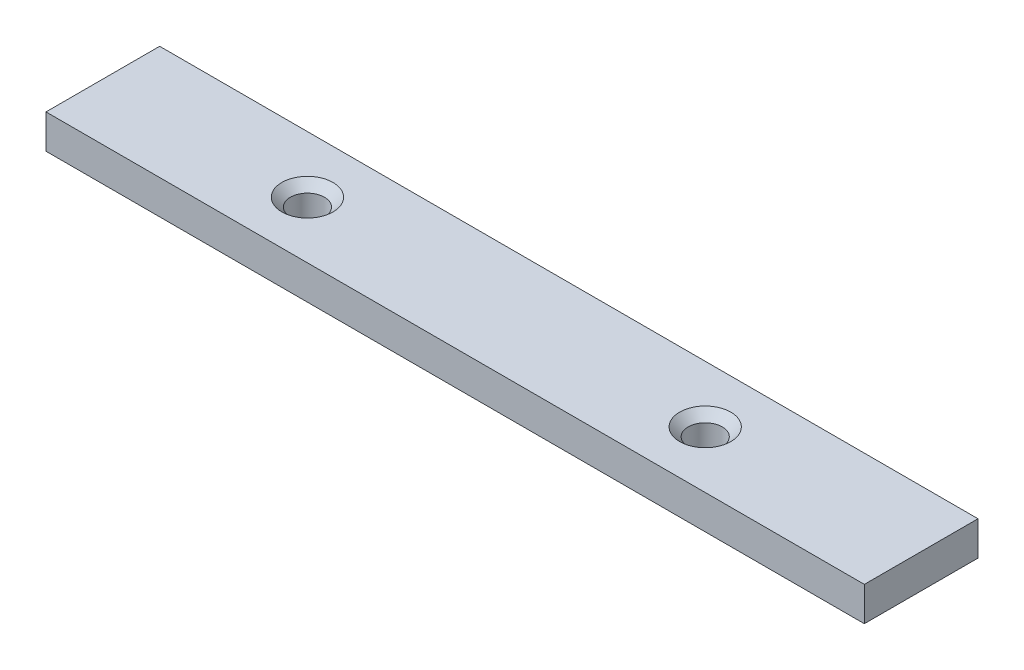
ISO-10303-21;
HEADER;
FILE_DESCRIPTION(('STEP AP214'),'2;1');
FILE_NAME('part.step','',(''),(''),'','','');
FILE_SCHEMA(('AUTOMOTIVE_DESIGN { 1 0 10303 214 1 1 1 1 }'));
ENDSEC;
DATA;
#1=APPLICATION_CONTEXT('core data for automotive mechanical design processes');
#2=APPLICATION_PROTOCOL_DEFINITION('international standard','automotive_design',2000,#1);
#3=PRODUCT_CONTEXT('',#1,'mechanical');
#4=PRODUCT('Part','Part','',(#3));
#5=PRODUCT_RELATED_PRODUCT_CATEGORY('part','',(#4));
#6=PRODUCT_DEFINITION_FORMATION('','',#4);
#7=PRODUCT_DEFINITION_CONTEXT('part definition',#1,'design');
#8=PRODUCT_DEFINITION('design','',#6,#7);
#9=PRODUCT_DEFINITION_SHAPE('','',#8);
#10=(LENGTH_UNIT() NAMED_UNIT(*) SI_UNIT(.MILLI.,.METRE.));
#11=(NAMED_UNIT(*) PLANE_ANGLE_UNIT() SI_UNIT($,.RADIAN.));
#12=(NAMED_UNIT(*) SI_UNIT($,.STERADIAN.) SOLID_ANGLE_UNIT());
#13=UNCERTAINTY_MEASURE_WITH_UNIT(LENGTH_MEASURE(1.E-05),#10,'distance_accuracy_value','');
#14=(GEOMETRIC_REPRESENTATION_CONTEXT(3) GLOBAL_UNCERTAINTY_ASSIGNED_CONTEXT((#13)) GLOBAL_UNIT_ASSIGNED_CONTEXT((#10,
#11,#12)) REPRESENTATION_CONTEXT('',''));
#15=CARTESIAN_POINT('',(0.,0.,0.));
#16=DIRECTION('',(0.,0.,1.));
#17=DIRECTION('',(1.,0.,0.));
#18=AXIS2_PLACEMENT_3D('',#15,#16,#17);
#19=CARTESIAN_POINT('',(72.,6.,10.));
#20=DIRECTION('',(-1.,0.,0.));
#21=DIRECTION('',(0.,0.,1.));
#22=AXIS2_PLACEMENT_3D('',#19,#20,#21);
#23=PLANE('',#22);
#24=DIRECTION('',(0.,0.,-1.));
#25=VECTOR('',#24,1.);
#26=CARTESIAN_POINT('',(72.,0.,10.));
#27=LINE('',#26,#25);
#28=CARTESIAN_POINT('',(72.,0.,10.));
#29=VERTEX_POINT('',#28);
#30=CARTESIAN_POINT('',(72.,0.,-10.));
#31=VERTEX_POINT('',#30);
#32=EDGE_CURVE('E96',#29,#31,#27,.T.);
#33=ORIENTED_EDGE('',*,*,#32,.T.);
#34=DIRECTION('',(0.,-1.,0.));
#35=VECTOR('',#34,1.);
#36=CARTESIAN_POINT('',(72.,6.,-10.));
#37=LINE('',#36,#35);
#38=CARTESIAN_POINT('',(72.,6.,-10.));
#39=VERTEX_POINT('',#38);
#40=EDGE_CURVE('E11',#39,#31,#37,.T.);
#41=ORIENTED_EDGE('',*,*,#40,.F.);
#42=DIRECTION('',(0.,0.,-1.));
#43=VECTOR('',#42,1.);
#44=CARTESIAN_POINT('',(72.,6.,10.));
#45=LINE('',#44,#43);
#46=CARTESIAN_POINT('',(72.,6.,10.));
#47=VERTEX_POINT('',#46);
#48=EDGE_CURVE('E84',#47,#39,#45,.T.);
#49=ORIENTED_EDGE('',*,*,#48,.F.);
#50=DIRECTION('',(0.,-1.,0.));
#51=VECTOR('',#50,1.);
#52=CARTESIAN_POINT('',(72.,6.,10.));
#53=LINE('',#52,#51);
#54=EDGE_CURVE('E92',#47,#29,#53,.T.);
#55=ORIENTED_EDGE('',*,*,#54,.T.);
#56=EDGE_LOOP('',(#33,#41,#49,#55));
#57=FACE_BOUND('',#56,.T.);
#58=ADVANCED_FACE('F33',(#57),#23,.F.);
#59=CARTESIAN_POINT('',(-72.,6.,-10.));
#60=DIRECTION('',(0.,0.,1.));
#61=DIRECTION('',(1.,0.,0.));
#62=AXIS2_PLACEMENT_3D('',#59,#60,#61);
#63=PLANE('',#62);
#64=DIRECTION('',(-1.,0.,0.));
#65=VECTOR('',#64,1.);
#66=CARTESIAN_POINT('',(-72.,0.,-10.));
#67=LINE('',#66,#65);
#68=CARTESIAN_POINT('',(-72.,0.,-10.));
#69=VERTEX_POINT('',#68);
#70=EDGE_CURVE('E88',#31,#69,#67,.T.);
#71=ORIENTED_EDGE('',*,*,#70,.T.);
#72=DIRECTION('',(0.,-1.,0.));
#73=VECTOR('',#72,1.);
#74=CARTESIAN_POINT('',(-72.,6.,-10.));
#75=LINE('',#74,#73);
#76=CARTESIAN_POINT('',(-72.,6.,-10.));
#77=VERTEX_POINT('',#76);
#78=EDGE_CURVE('E41',#77,#69,#75,.T.);
#79=ORIENTED_EDGE('',*,*,#78,.F.);
#80=DIRECTION('',(-1.,0.,0.));
#81=VECTOR('',#80,1.);
#82=CARTESIAN_POINT('',(-72.,6.,-10.));
#83=LINE('',#82,#81);
#84=EDGE_CURVE('E79',#39,#77,#83,.T.);
#85=ORIENTED_EDGE('',*,*,#84,.F.);
#86=ORIENTED_EDGE('',*,*,#40,.T.);
#87=EDGE_LOOP('',(#71,#79,#85,#86));
#88=FACE_BOUND('',#87,.T.);
#89=ADVANCED_FACE('F87',(#88),#63,.F.);
#90=CARTESIAN_POINT('',(-72.,6.,10.));
#91=DIRECTION('',(1.,0.,0.));
#92=DIRECTION('',(0.,0.,-1.));
#93=AXIS2_PLACEMENT_3D('',#90,#91,#92);
#94=PLANE('',#93);
#95=DIRECTION('',(0.,0.,1.));
#96=VECTOR('',#95,1.);
#97=CARTESIAN_POINT('',(-72.,0.,10.));
#98=LINE('',#97,#96);
#99=CARTESIAN_POINT('',(-72.,0.,10.));
#100=VERTEX_POINT('',#99);
#101=EDGE_CURVE('E66',#69,#100,#98,.T.);
#102=ORIENTED_EDGE('',*,*,#101,.T.);
#103=DIRECTION('',(0.,-1.,0.));
#104=VECTOR('',#103,1.);
#105=CARTESIAN_POINT('',(-72.,6.,10.));
#106=LINE('',#105,#104);
#107=CARTESIAN_POINT('',(-72.,6.,10.));
#108=VERTEX_POINT('',#107);
#109=EDGE_CURVE('E89',#108,#100,#106,.T.);
#110=ORIENTED_EDGE('',*,*,#109,.F.);
#111=DIRECTION('',(0.,0.,1.));
#112=VECTOR('',#111,1.);
#113=CARTESIAN_POINT('',(-72.,6.,10.));
#114=LINE('',#113,#112);
#115=EDGE_CURVE('E82',#77,#108,#114,.T.);
#116=ORIENTED_EDGE('',*,*,#115,.F.);
#117=ORIENTED_EDGE('',*,*,#78,.T.);
#118=EDGE_LOOP('',(#102,#110,#116,#117));
#119=FACE_BOUND('',#118,.T.);
#120=ADVANCED_FACE('F90',(#119),#94,.F.);
#121=CARTESIAN_POINT('',(-72.,6.,10.));
#122=DIRECTION('',(0.,0.,-1.));
#123=DIRECTION('',(-1.,0.,0.));
#124=AXIS2_PLACEMENT_3D('',#121,#122,#123);
#125=PLANE('',#124);
#126=DIRECTION('',(1.,0.,0.));
#127=VECTOR('',#126,1.);
#128=CARTESIAN_POINT('',(-72.,0.,10.));
#129=LINE('',#128,#127);
#130=EDGE_CURVE('E72',#100,#29,#129,.T.);
#131=ORIENTED_EDGE('',*,*,#130,.T.);
#132=ORIENTED_EDGE('',*,*,#54,.F.);
#133=DIRECTION('',(1.,0.,0.));
#134=VECTOR('',#133,1.);
#135=CARTESIAN_POINT('',(-72.,6.,10.));
#136=LINE('',#135,#134);
#137=EDGE_CURVE('E49',#108,#47,#136,.T.);
#138=ORIENTED_EDGE('',*,*,#137,.F.);
#139=ORIENTED_EDGE('',*,*,#109,.T.);
#140=EDGE_LOOP('',(#131,#132,#138,#139));
#141=FACE_BOUND('',#140,.T.);
#142=ADVANCED_FACE('F104',(#141),#125,.F.);
#143=CARTESIAN_POINT('',(72.,6.,-10.));
#144=DIRECTION('',(0.,-1.,0.));
#145=DIRECTION('',(0.,0.,-1.));
#146=AXIS2_PLACEMENT_3D('',#143,#144,#145);
#147=PLANE('',#146);
#148=CARTESIAN_POINT('',(-36.,6.,0.));
#149=DIRECTION('',(0.,1.,0.));
#150=DIRECTION('',(0.,0.,1.));
#151=AXIS2_PLACEMENT_3D('',#148,#149,#150);
#152=CIRCLE('',#151,4.5);
#153=CARTESIAN_POINT('',(-36.,6.,4.5));
#154=VERTEX_POINT('',#153);
#155=EDGE_CURVE('E124',#154,#154,#152,.T.);
#156=ORIENTED_EDGE('',*,*,#155,.F.);
#157=EDGE_LOOP('',(#156));
#158=FACE_BOUND('',#157,.T.);
#159=CARTESIAN_POINT('',(34.,6.,0.));
#160=DIRECTION('',(0.,1.,0.));
#161=DIRECTION('',(0.,0.,1.));
#162=AXIS2_PLACEMENT_3D('',#159,#160,#161);
#163=CIRCLE('',#162,4.5);
#164=CARTESIAN_POINT('',(34.,6.,4.5));
#165=VERTEX_POINT('',#164);
#166=EDGE_CURVE('E115',#165,#165,#163,.T.);
#167=ORIENTED_EDGE('',*,*,#166,.F.);
#168=EDGE_LOOP('',(#167));
#169=FACE_BOUND('',#168,.T.);
#170=ORIENTED_EDGE('',*,*,#48,.T.);
#171=ORIENTED_EDGE('',*,*,#84,.T.);
#172=ORIENTED_EDGE('',*,*,#115,.T.);
#173=ORIENTED_EDGE('',*,*,#137,.T.);
#174=EDGE_LOOP('',(#170,#171,#172,#173));
#175=FACE_BOUND('',#174,.T.);
#176=ADVANCED_FACE('F80',(#158,#169,#175),#147,.F.);
#177=CARTESIAN_POINT('',(72.,0.,-10.));
#178=DIRECTION('',(0.,-1.,0.));
#179=DIRECTION('',(0.,0.,-1.));
#180=AXIS2_PLACEMENT_3D('',#177,#178,#179);
#181=PLANE('',#180);
#182=CARTESIAN_POINT('',(-36.,0.,0.));
#183=DIRECTION('',(0.,1.,0.));
#184=DIRECTION('',(0.,0.,1.));
#185=AXIS2_PLACEMENT_3D('',#182,#183,#184);
#186=CIRCLE('',#185,3.);
#187=CARTESIAN_POINT('',(-36.,0.,3.));
#188=VERTEX_POINT('',#187);
#189=EDGE_CURVE('E118',#188,#188,#186,.T.);
#190=ORIENTED_EDGE('',*,*,#189,.T.);
#191=EDGE_LOOP('',(#190));
#192=FACE_BOUND('',#191,.T.);
#193=CARTESIAN_POINT('',(34.,0.,0.));
#194=DIRECTION('',(0.,1.,0.));
#195=DIRECTION('',(0.,0.,1.));
#196=AXIS2_PLACEMENT_3D('',#193,#194,#195);
#197=CIRCLE('',#196,3.);
#198=CARTESIAN_POINT('',(34.,0.,3.));
#199=VERTEX_POINT('',#198);
#200=EDGE_CURVE('E99',#199,#199,#197,.T.);
#201=ORIENTED_EDGE('',*,*,#200,.T.);
#202=EDGE_LOOP('',(#201));
#203=FACE_BOUND('',#202,.T.);
#204=ORIENTED_EDGE('',*,*,#32,.F.);
#205=ORIENTED_EDGE('',*,*,#130,.F.);
#206=ORIENTED_EDGE('',*,*,#101,.F.);
#207=ORIENTED_EDGE('',*,*,#70,.F.);
#208=EDGE_LOOP('',(#204,#205,#206,#207));
#209=FACE_BOUND('',#208,.T.);
#210=ADVANCED_FACE('F107',(#192,#203,#209),#181,.T.);
#211=CARTESIAN_POINT('',(34.,6.,0.));
#212=DIRECTION('',(0.,1.,0.));
#213=DIRECTION('',(0.,0.,1.));
#214=AXIS2_PLACEMENT_3D('',#211,#212,#213);
#215=CYLINDRICAL_SURFACE('',#214,3.);
#216=ORIENTED_EDGE('',*,*,#200,.F.);
#217=EDGE_LOOP('',(#216));
#218=FACE_BOUND('',#217,.T.);
#219=CARTESIAN_POINT('',(34.,4.5,0.));
#220=DIRECTION('',(0.,1.,0.));
#221=DIRECTION('',(0.,0.,1.));
#222=AXIS2_PLACEMENT_3D('',#219,#220,#221);
#223=CIRCLE('',#222,3.);
#224=CARTESIAN_POINT('',(34.,4.5,3.));
#225=VERTEX_POINT('',#224);
#226=EDGE_CURVE('E112',#225,#225,#223,.T.);
#227=ORIENTED_EDGE('',*,*,#226,.T.);
#228=EDGE_LOOP('',(#227));
#229=FACE_BOUND('',#228,.T.);
#230=ADVANCED_FACE('F138',(#218,#229),#215,.F.);
#231=CARTESIAN_POINT('',(34.,6.,0.));
#232=DIRECTION('',(0.,1.,0.));
#233=DIRECTION('',(0.,0.,1.));
#234=AXIS2_PLACEMENT_3D('',#231,#232,#233);
#235=CONICAL_SURFACE('',#234,4.5,0.78539816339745);
#236=ORIENTED_EDGE('',*,*,#226,.F.);
#237=EDGE_LOOP('',(#236));
#238=FACE_BOUND('',#237,.T.);
#239=ORIENTED_EDGE('',*,*,#166,.T.);
#240=EDGE_LOOP('',(#239));
#241=FACE_BOUND('',#240,.T.);
#242=ADVANCED_FACE('F135',(#238,#241),#235,.F.);
#243=CARTESIAN_POINT('',(-36.,6.,0.));
#244=DIRECTION('',(0.,1.,0.));
#245=DIRECTION('',(0.,0.,1.));
#246=AXIS2_PLACEMENT_3D('',#243,#244,#245);
#247=CYLINDRICAL_SURFACE('',#246,3.);
#248=ORIENTED_EDGE('',*,*,#189,.F.);
#249=EDGE_LOOP('',(#248));
#250=FACE_BOUND('',#249,.T.);
#251=CARTESIAN_POINT('',(-36.,4.5,0.));
#252=DIRECTION('',(0.,1.,0.));
#253=DIRECTION('',(0.,0.,1.));
#254=AXIS2_PLACEMENT_3D('',#251,#252,#253);
#255=CIRCLE('',#254,3.);
#256=CARTESIAN_POINT('',(-36.,4.5,3.));
#257=VERTEX_POINT('',#256);
#258=EDGE_CURVE('E121',#257,#257,#255,.T.);
#259=ORIENTED_EDGE('',*,*,#258,.T.);
#260=EDGE_LOOP('',(#259));
#261=FACE_BOUND('',#260,.T.);
#262=ADVANCED_FACE('F137',(#250,#261),#247,.F.);
#263=CARTESIAN_POINT('',(-36.,6.,0.));
#264=DIRECTION('',(0.,1.,0.));
#265=DIRECTION('',(0.,0.,1.));
#266=AXIS2_PLACEMENT_3D('',#263,#264,#265);
#267=CONICAL_SURFACE('',#266,4.5,0.78539816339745);
#268=ORIENTED_EDGE('',*,*,#258,.F.);
#269=EDGE_LOOP('',(#268));
#270=FACE_BOUND('',#269,.T.);
#271=ORIENTED_EDGE('',*,*,#155,.T.);
#272=EDGE_LOOP('',(#271));
#273=FACE_BOUND('',#272,.T.);
#274=ADVANCED_FACE('F128',(#270,#273),#267,.F.);
#275=CLOSED_SHELL('',(#58,#89,#120,#142,#176,#210,#230,#242,#262,#274));
#276=MANIFOLD_SOLID_BREP('B2',#275);
#277=ADVANCED_BREP_SHAPE_REPRESENTATION('',(#18,#276),#14);
#278=SHAPE_DEFINITION_REPRESENTATION(#9,#277);
ENDSEC;
END-ISO-10303-21;
